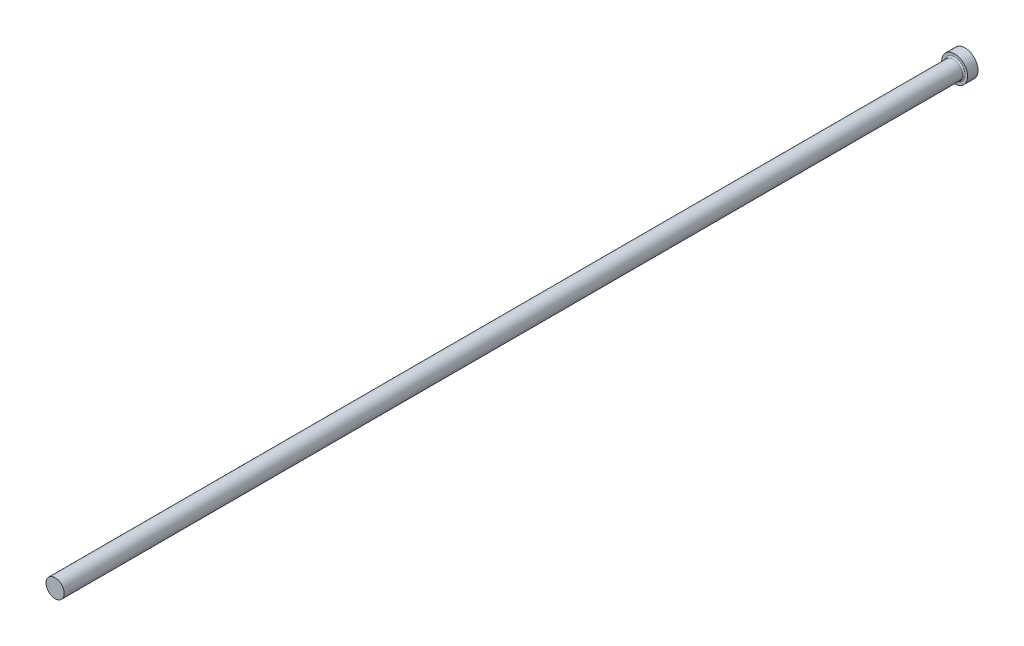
from build123d import *

# Parameters (mm, degrees)
FILLET1_R = 0.5


with BuildPart() as part:
    # FV → Revolve1 (revolve)
    with BuildSketch(Plane(origin=(0, 0, 0), x_dir=(1, 0, 0), z_dir=(0, 1, 0)), mode=Mode.PRIVATE) as revolve1_sk:
        Polygon((0, 0), (5, 0), (5, -4), (3.5, -4), (3.5, -350), (0, -350), align=None)
    revolve(revolve1_sk.sketch.rotate(Axis((0, 0, -9.033228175), (0, 0, 1)), 180), axis=Axis((0, 0, -9.033228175), (0, 0, 1)))

    # Fillet1
    fillet1_edges = [part.edges().sort_by_distance(p)[0] for p in [
        (3.5, 0, 4),
    ]]
    fillet(fillet1_edges, radius=FILLET1_R)


solid = part.part
